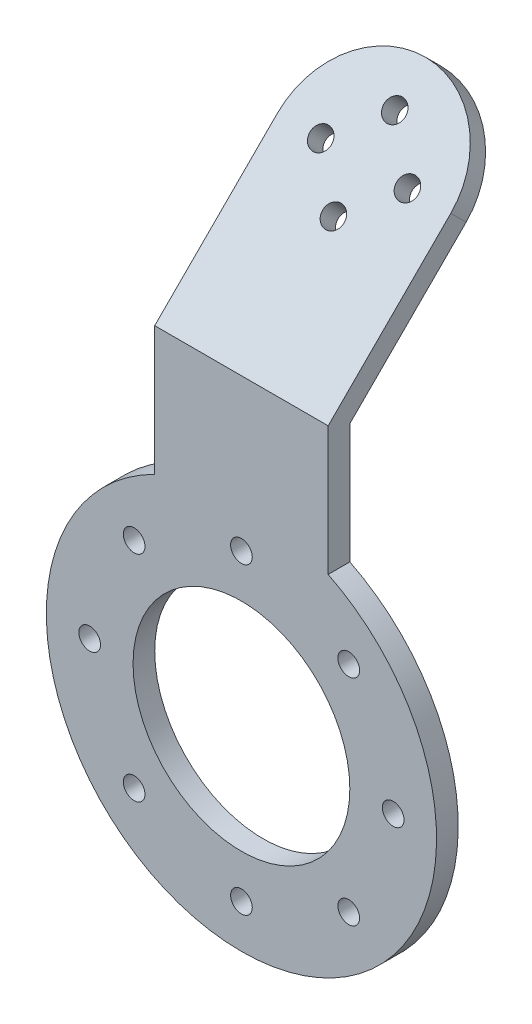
ISO-10303-21;
HEADER;
FILE_DESCRIPTION(('STEP AP214'),'2;1');
FILE_NAME('part.step','',(''),(''),'','','');
FILE_SCHEMA(('AUTOMOTIVE_DESIGN { 1 0 10303 214 1 1 1 1 }'));
ENDSEC;
DATA;
#1=APPLICATION_CONTEXT('core data for automotive mechanical design processes');
#2=APPLICATION_PROTOCOL_DEFINITION('international standard','automotive_design',2000,#1);
#3=PRODUCT_CONTEXT('',#1,'mechanical');
#4=PRODUCT('Part','Part','',(#3));
#5=PRODUCT_RELATED_PRODUCT_CATEGORY('part','',(#4));
#6=PRODUCT_DEFINITION_FORMATION('','',#4);
#7=PRODUCT_DEFINITION_CONTEXT('part definition',#1,'design');
#8=PRODUCT_DEFINITION('design','',#6,#7);
#9=PRODUCT_DEFINITION_SHAPE('','',#8);
#10=(LENGTH_UNIT() NAMED_UNIT(*) SI_UNIT(.MILLI.,.METRE.));
#11=(NAMED_UNIT(*) PLANE_ANGLE_UNIT() SI_UNIT($,.RADIAN.));
#12=(NAMED_UNIT(*) SI_UNIT($,.STERADIAN.) SOLID_ANGLE_UNIT());
#13=UNCERTAINTY_MEASURE_WITH_UNIT(LENGTH_MEASURE(1.E-05),#10,'distance_accuracy_value','');
#14=(GEOMETRIC_REPRESENTATION_CONTEXT(3) GLOBAL_UNCERTAINTY_ASSIGNED_CONTEXT((#13)) GLOBAL_UNIT_ASSIGNED_CONTEXT((#10,
#11,#12)) REPRESENTATION_CONTEXT('',''));
#15=CARTESIAN_POINT('',(0.,0.,0.));
#16=DIRECTION('',(0.,0.,1.));
#17=DIRECTION('',(1.,0.,0.));
#18=AXIS2_PLACEMENT_3D('',#15,#16,#17);
#19=CARTESIAN_POINT('',(0.,0.,3.175));
#20=DIRECTION('',(0.,0.,1.));
#21=DIRECTION('',(1.,0.,0.));
#22=AXIS2_PLACEMENT_3D('',#19,#20,#21);
#23=PLANE('',#22);
#24=CARTESIAN_POINT('',(15.7154482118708,15.7154482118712,3.175));
#25=DIRECTION('',(0.,0.,1.));
#26=DIRECTION('',(0.707106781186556,-0.707106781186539,0.));
#27=AXIS2_PLACEMENT_3D('',#24,#25,#26);
#28=CIRCLE('',#27,1.5875);
#29=CARTESIAN_POINT('',(16.8379802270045,14.5929161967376,3.175));
#30=VERTEX_POINT('',#29);
#31=EDGE_CURVE('E145',#30,#30,#28,.T.);
#32=ORIENTED_EDGE('',*,*,#31,.F.);
#33=EDGE_LOOP('',(#32));
#34=FACE_BOUND('',#33,.T.);
#35=CARTESIAN_POINT('',(22.225,2.32794653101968E-13,3.175));
#36=DIRECTION('',(0.,0.,1.));
#37=DIRECTION('',(0.,-1.,0.));
#38=AXIS2_PLACEMENT_3D('',#35,#36,#37);
#39=CIRCLE('',#38,1.5875);
#40=CARTESIAN_POINT('',(22.225,-1.58749999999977,3.175));
#41=VERTEX_POINT('',#40);
#42=EDGE_CURVE('E135',#41,#41,#39,.T.);
#43=ORIENTED_EDGE('',*,*,#42,.F.);
#44=EDGE_LOOP('',(#43));
#45=FACE_BOUND('',#44,.T.);
#46=CARTESIAN_POINT('',(15.7154482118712,-15.7154482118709,3.175));
#47=DIRECTION('',(0.,0.,1.));
#48=DIRECTION('',(-0.707106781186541,-0.707106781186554,0.));
#49=AXIS2_PLACEMENT_3D('',#46,#47,#48);
#50=CIRCLE('',#49,1.5875);
#51=CARTESIAN_POINT('',(14.5929161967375,-16.8379802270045,3.175));
#52=VERTEX_POINT('',#51);
#53=EDGE_CURVE('E132',#52,#52,#50,.T.);
#54=ORIENTED_EDGE('',*,*,#53,.F.);
#55=EDGE_LOOP('',(#54));
#56=FACE_BOUND('',#55,.T.);
#57=CARTESIAN_POINT('',(1.55196435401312E-13,-22.225,3.175));
#58=DIRECTION('',(0.,0.,1.));
#59=DIRECTION('',(-1.,0.,0.));
#60=AXIS2_PLACEMENT_3D('',#57,#58,#59);
#61=CIRCLE('',#60,1.5875);
#62=CARTESIAN_POINT('',(-1.58749999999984,-22.225,3.175));
#63=VERTEX_POINT('',#62);
#64=EDGE_CURVE('E129',#63,#63,#61,.T.);
#65=ORIENTED_EDGE('',*,*,#64,.F.);
#66=EDGE_LOOP('',(#65));
#67=FACE_BOUND('',#66,.T.);
#68=CARTESIAN_POINT('',(-15.7154482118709,-15.7154482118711,3.175));
#69=DIRECTION('',(0.,0.,1.));
#70=DIRECTION('',(-0.707106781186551,0.707106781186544,0.));
#71=AXIS2_PLACEMENT_3D('',#68,#69,#70);
#72=CIRCLE('',#71,1.5875);
#73=CARTESIAN_POINT('',(-16.8379802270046,-14.5929161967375,3.175));
#74=VERTEX_POINT('',#73);
#75=EDGE_CURVE('E125',#74,#74,#72,.T.);
#76=ORIENTED_EDGE('',*,*,#75,.F.);
#77=EDGE_LOOP('',(#76));
#78=FACE_BOUND('',#77,.T.);
#79=CARTESIAN_POINT('',(-22.225,0.,3.175));
#80=DIRECTION('',(0.,0.,1.));
#81=DIRECTION('',(0.,1.,0.));
#82=AXIS2_PLACEMENT_3D('',#79,#80,#81);
#83=CIRCLE('',#82,1.5875);
#84=CARTESIAN_POINT('',(-22.225,1.58749999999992,3.175));
#85=VERTEX_POINT('',#84);
#86=EDGE_CURVE('E121',#85,#85,#83,.T.);
#87=ORIENTED_EDGE('',*,*,#86,.F.);
#88=EDGE_LOOP('',(#87));
#89=FACE_BOUND('',#88,.T.);
#90=CARTESIAN_POINT('',(-15.715448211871,15.715448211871,3.175));
#91=DIRECTION('',(0.,0.,1.));
#92=DIRECTION('',(0.707106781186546,0.707106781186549,0.));
#93=AXIS2_PLACEMENT_3D('',#90,#91,#92);
#94=CIRCLE('',#93,1.5875);
#95=CARTESIAN_POINT('',(-14.5929161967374,16.8379802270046,3.175));
#96=VERTEX_POINT('',#95);
#97=EDGE_CURVE('E117',#96,#96,#94,.T.);
#98=ORIENTED_EDGE('',*,*,#97,.F.);
#99=EDGE_LOOP('',(#98));
#100=FACE_BOUND('',#99,.T.);
#101=CARTESIAN_POINT('',(0.,22.225,3.175));
#102=DIRECTION('',(0.,0.,1.));
#103=DIRECTION('',(1.,0.,0.));
#104=AXIS2_PLACEMENT_3D('',#101,#102,#103);
#105=CIRCLE('',#104,1.5875);
#106=CARTESIAN_POINT('',(1.5875,22.225,3.175));
#107=VERTEX_POINT('',#106);
#108=EDGE_CURVE('E113',#107,#107,#105,.T.);
#109=ORIENTED_EDGE('',*,*,#108,.F.);
#110=EDGE_LOOP('',(#109));
#111=FACE_BOUND('',#110,.T.);
#112=CARTESIAN_POINT('',(0.,0.,3.175));
#113=DIRECTION('',(0.,0.,1.));
#114=DIRECTION('',(1.,0.,0.));
#115=AXIS2_PLACEMENT_3D('',#112,#113,#114);
#116=CIRCLE('',#115,28.575);
#117=CARTESIAN_POINT('',(-12.7,25.5976683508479,3.175));
#118=VERTEX_POINT('',#117);
#119=CARTESIAN_POINT('',(12.7,25.5976683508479,3.175));
#120=VERTEX_POINT('',#119);
#121=EDGE_CURVE('E89',#118,#120,#116,.T.);
#122=ORIENTED_EDGE('',*,*,#121,.T.);
#123=DIRECTION('',(0.,1.,0.));
#124=VECTOR('',#123,1.);
#125=CARTESIAN_POINT('',(12.7,25.5976683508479,3.175));
#126=LINE('',#125,#124);
#127=CARTESIAN_POINT('',(12.7,44.45,3.175));
#128=VERTEX_POINT('',#127);
#129=EDGE_CURVE('E79',#120,#128,#126,.T.);
#130=ORIENTED_EDGE('',*,*,#129,.T.);
#131=DIRECTION('',(-1.,0.,0.));
#132=VECTOR('',#131,1.);
#133=CARTESIAN_POINT('',(-12.7,44.45,3.175));
#134=LINE('',#133,#132);
#135=CARTESIAN_POINT('',(-12.7,44.45,3.175));
#136=VERTEX_POINT('',#135);
#137=EDGE_CURVE('E88',#128,#136,#134,.T.);
#138=ORIENTED_EDGE('',*,*,#137,.T.);
#139=DIRECTION('',(0.,-1.,0.));
#140=VECTOR('',#139,1.);
#141=CARTESIAN_POINT('',(-12.7,25.5976683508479,3.175));
#142=LINE('',#141,#140);
#143=EDGE_CURVE('E49',#136,#118,#142,.T.);
#144=ORIENTED_EDGE('',*,*,#143,.T.);
#145=EDGE_LOOP('',(#122,#130,#138,#144));
#146=FACE_BOUND('',#145,.T.);
#147=CARTESIAN_POINT('',(0.,0.,3.175));
#148=DIRECTION('',(0.,0.,1.));
#149=DIRECTION('',(1.,0.,0.));
#150=AXIS2_PLACEMENT_3D('',#147,#148,#149);
#151=CIRCLE('',#150,15.875);
#152=CARTESIAN_POINT('',(15.875,0.,3.175));
#153=VERTEX_POINT('',#152);
#154=EDGE_CURVE('E99',#153,#153,#151,.T.);
#155=ORIENTED_EDGE('',*,*,#154,.F.);
#156=EDGE_LOOP('',(#155));
#157=FACE_BOUND('',#156,.T.);
#158=ADVANCED_FACE('F30',(#34,#45,#56,#67,#78,#89,#100,#111,#146,#157),#23,.T.);
#159=CARTESIAN_POINT('',(0.,0.,0.));
#160=DIRECTION('',(0.,0.,1.));
#161=DIRECTION('',(1.,0.,0.));
#162=AXIS2_PLACEMENT_3D('',#159,#160,#161);
#163=PLANE('',#162);
#164=CARTESIAN_POINT('',(15.7154482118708,15.7154482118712,0.));
#165=DIRECTION('',(0.,0.,1.));
#166=DIRECTION('',(1.,0.,0.));
#167=AXIS2_PLACEMENT_3D('',#164,#165,#166);
#168=CIRCLE('',#167,1.5875);
#169=CARTESIAN_POINT('',(17.3029482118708,15.7154482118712,0.));
#170=VERTEX_POINT('',#169);
#171=EDGE_CURVE('E34',#170,#170,#168,.T.);
#172=ORIENTED_EDGE('',*,*,#171,.T.);
#173=EDGE_LOOP('',(#172));
#174=FACE_BOUND('',#173,.T.);
#175=CARTESIAN_POINT('',(22.225,2.32794653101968E-13,0.));
#176=DIRECTION('',(0.,0.,1.));
#177=DIRECTION('',(1.,0.,0.));
#178=AXIS2_PLACEMENT_3D('',#175,#176,#177);
#179=CIRCLE('',#178,1.5875);
#180=CARTESIAN_POINT('',(23.8125,2.32794653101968E-13,0.));
#181=VERTEX_POINT('',#180);
#182=EDGE_CURVE('E133',#181,#181,#179,.T.);
#183=ORIENTED_EDGE('',*,*,#182,.T.);
#184=EDGE_LOOP('',(#183));
#185=FACE_BOUND('',#184,.T.);
#186=CARTESIAN_POINT('',(15.7154482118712,-15.7154482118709,0.));
#187=DIRECTION('',(0.,0.,1.));
#188=DIRECTION('',(1.,0.,0.));
#189=AXIS2_PLACEMENT_3D('',#186,#187,#188);
#190=CIRCLE('',#189,1.5875);
#191=CARTESIAN_POINT('',(17.3029482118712,-15.7154482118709,0.));
#192=VERTEX_POINT('',#191);
#193=EDGE_CURVE('E130',#192,#192,#190,.T.);
#194=ORIENTED_EDGE('',*,*,#193,.T.);
#195=EDGE_LOOP('',(#194));
#196=FACE_BOUND('',#195,.T.);
#197=CARTESIAN_POINT('',(1.55196435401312E-13,-22.225,0.));
#198=DIRECTION('',(0.,0.,1.));
#199=DIRECTION('',(1.,0.,0.));
#200=AXIS2_PLACEMENT_3D('',#197,#198,#199);
#201=CIRCLE('',#200,1.5875);
#202=CARTESIAN_POINT('',(1.58750000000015,-22.225,0.));
#203=VERTEX_POINT('',#202);
#204=EDGE_CURVE('E126',#203,#203,#201,.T.);
#205=ORIENTED_EDGE('',*,*,#204,.T.);
#206=EDGE_LOOP('',(#205));
#207=FACE_BOUND('',#206,.T.);
#208=CARTESIAN_POINT('',(-15.7154482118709,-15.7154482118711,0.));
#209=DIRECTION('',(0.,0.,1.));
#210=DIRECTION('',(1.,0.,0.));
#211=AXIS2_PLACEMENT_3D('',#208,#209,#210);
#212=CIRCLE('',#211,1.5875);
#213=CARTESIAN_POINT('',(-14.1279482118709,-15.7154482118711,0.));
#214=VERTEX_POINT('',#213);
#215=EDGE_CURVE('E122',#214,#214,#212,.T.);
#216=ORIENTED_EDGE('',*,*,#215,.T.);
#217=EDGE_LOOP('',(#216));
#218=FACE_BOUND('',#217,.T.);
#219=CARTESIAN_POINT('',(-22.225,0.,0.));
#220=DIRECTION('',(0.,0.,1.));
#221=DIRECTION('',(1.,0.,0.));
#222=AXIS2_PLACEMENT_3D('',#219,#220,#221);
#223=CIRCLE('',#222,1.5875);
#224=CARTESIAN_POINT('',(-20.6375,0.,0.));
#225=VERTEX_POINT('',#224);
#226=EDGE_CURVE('E118',#225,#225,#223,.T.);
#227=ORIENTED_EDGE('',*,*,#226,.T.);
#228=EDGE_LOOP('',(#227));
#229=FACE_BOUND('',#228,.T.);
#230=CARTESIAN_POINT('',(-15.715448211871,15.715448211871,0.));
#231=DIRECTION('',(0.,0.,1.));
#232=DIRECTION('',(1.,0.,0.));
#233=AXIS2_PLACEMENT_3D('',#230,#231,#232);
#234=CIRCLE('',#233,1.5875);
#235=CARTESIAN_POINT('',(-14.127948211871,15.715448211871,0.));
#236=VERTEX_POINT('',#235);
#237=EDGE_CURVE('E114',#236,#236,#234,.T.);
#238=ORIENTED_EDGE('',*,*,#237,.T.);
#239=EDGE_LOOP('',(#238));
#240=FACE_BOUND('',#239,.T.);
#241=CARTESIAN_POINT('',(0.,22.225,0.));
#242=DIRECTION('',(0.,0.,1.));
#243=DIRECTION('',(1.,0.,0.));
#244=AXIS2_PLACEMENT_3D('',#241,#242,#243);
#245=CIRCLE('',#244,1.5875);
#246=CARTESIAN_POINT('',(1.5875,22.225,0.));
#247=VERTEX_POINT('',#246);
#248=EDGE_CURVE('E110',#247,#247,#245,.T.);
#249=ORIENTED_EDGE('',*,*,#248,.T.);
#250=EDGE_LOOP('',(#249));
#251=FACE_BOUND('',#250,.T.);
#252=DIRECTION('',(0.,-1.,0.));
#253=VECTOR('',#252,1.);
#254=CARTESIAN_POINT('',(-12.7,25.5976683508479,0.));
#255=LINE('',#254,#253);
#256=CARTESIAN_POINT('',(-12.7,43.1348719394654,0.));
#257=VERTEX_POINT('',#256);
#258=CARTESIAN_POINT('',(-12.7,25.5976683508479,0.));
#259=VERTEX_POINT('',#258);
#260=EDGE_CURVE('E95',#257,#259,#255,.T.);
#261=ORIENTED_EDGE('',*,*,#260,.F.);
#262=DIRECTION('',(1.,0.,0.));
#263=VECTOR('',#262,1.);
#264=CARTESIAN_POINT('',(0.,43.1348719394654,0.));
#265=LINE('',#264,#263);
#266=CARTESIAN_POINT('',(12.7,43.1348719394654,0.));
#267=VERTEX_POINT('',#266);
#268=EDGE_CURVE('E176',#257,#267,#265,.T.);
#269=ORIENTED_EDGE('',*,*,#268,.T.);
#270=DIRECTION('',(0.,1.,0.));
#271=VECTOR('',#270,1.);
#272=CARTESIAN_POINT('',(12.7,25.5976683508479,0.));
#273=LINE('',#272,#271);
#274=CARTESIAN_POINT('',(12.7,25.5976683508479,0.));
#275=VERTEX_POINT('',#274);
#276=EDGE_CURVE('E62',#275,#267,#273,.T.);
#277=ORIENTED_EDGE('',*,*,#276,.F.);
#278=CARTESIAN_POINT('',(0.,0.,0.));
#279=DIRECTION('',(0.,0.,1.));
#280=DIRECTION('',(1.,0.,0.));
#281=AXIS2_PLACEMENT_3D('',#278,#279,#280);
#282=CIRCLE('',#281,28.575);
#283=EDGE_CURVE('E97',#259,#275,#282,.T.);
#284=ORIENTED_EDGE('',*,*,#283,.F.);
#285=EDGE_LOOP('',(#261,#269,#277,#284));
#286=FACE_BOUND('',#285,.T.);
#287=CARTESIAN_POINT('',(0.,0.,0.));
#288=DIRECTION('',(0.,0.,1.));
#289=DIRECTION('',(1.,0.,0.));
#290=AXIS2_PLACEMENT_3D('',#287,#288,#289);
#291=CIRCLE('',#290,15.875);
#292=CARTESIAN_POINT('',(15.875,0.,0.));
#293=VERTEX_POINT('',#292);
#294=EDGE_CURVE('E103',#293,#293,#291,.T.);
#295=ORIENTED_EDGE('',*,*,#294,.T.);
#296=EDGE_LOOP('',(#295));
#297=FACE_BOUND('',#296,.T.);
#298=ADVANCED_FACE('F187',(#174,#185,#196,#207,#218,#229,#240,#251,#286,#297),#163,.F.);
#299=CARTESIAN_POINT('',(0.,0.,3.175));
#300=DIRECTION('',(0.,0.,-1.));
#301=DIRECTION('',(-1.,0.,0.));
#302=AXIS2_PLACEMENT_3D('',#299,#300,#301);
#303=CYLINDRICAL_SURFACE('',#302,28.575);
#304=ORIENTED_EDGE('',*,*,#283,.T.);
#305=DIRECTION('',(0.,0.,-1.));
#306=VECTOR('',#305,1.);
#307=CARTESIAN_POINT('',(12.7,25.5976683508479,3.175));
#308=LINE('',#307,#306);
#309=EDGE_CURVE('E11',#120,#275,#308,.T.);
#310=ORIENTED_EDGE('',*,*,#309,.F.);
#311=ORIENTED_EDGE('',*,*,#121,.F.);
#312=DIRECTION('',(0.,0.,-1.));
#313=VECTOR('',#312,1.);
#314=CARTESIAN_POINT('',(-12.7,25.5976683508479,3.175));
#315=LINE('',#314,#313);
#316=EDGE_CURVE('E40',#118,#259,#315,.T.);
#317=ORIENTED_EDGE('',*,*,#316,.T.);
#318=EDGE_LOOP('',(#304,#310,#311,#317));
#319=FACE_BOUND('',#318,.T.);
#320=ADVANCED_FACE('F32',(#319),#303,.T.);
#321=CARTESIAN_POINT('',(12.7,25.5976683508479,3.175));
#322=DIRECTION('',(-1.,0.,0.));
#323=DIRECTION('',(0.,-1.,0.));
#324=AXIS2_PLACEMENT_3D('',#321,#322,#323);
#325=PLANE('',#324);
#326=DIRECTION('',(0.,0.707106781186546,-0.707106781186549));
#327=VECTOR('',#326,1.);
#328=CARTESIAN_POINT('',(12.7,62.4105122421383,-14.7855122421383));
#329=LINE('',#328,#327);
#330=CARTESIAN_POINT('',(12.7,62.4105122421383,-14.7855122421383));
#331=VERTEX_POINT('',#330);
#332=EDGE_CURVE('E86',#128,#331,#329,.T.);
#333=ORIENTED_EDGE('',*,*,#332,.F.);
#334=ORIENTED_EDGE('',*,*,#129,.F.);
#335=ORIENTED_EDGE('',*,*,#309,.T.);
#336=ORIENTED_EDGE('',*,*,#276,.T.);
#337=DIRECTION('',(0.,0.707106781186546,-0.707106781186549));
#338=VECTOR('',#337,1.);
#339=CARTESIAN_POINT('',(12.7,60.165448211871,-17.0305762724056));
#340=LINE('',#339,#338);
#341=CARTESIAN_POINT('',(12.7,60.165448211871,-17.0305762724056));
#342=VERTEX_POINT('',#341);
#343=EDGE_CURVE('E71',#267,#342,#340,.T.);
#344=ORIENTED_EDGE('',*,*,#343,.T.);
#345=DIRECTION('',(0.,0.707106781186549,0.707106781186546));
#346=VECTOR('',#345,1.);
#347=CARTESIAN_POINT('',(12.7,60.165448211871,-17.0305762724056));
#348=LINE('',#347,#346);
#349=EDGE_CURVE('E167',#342,#331,#348,.T.);
#350=ORIENTED_EDGE('',*,*,#349,.T.);
#351=EDGE_LOOP('',(#333,#334,#335,#336,#344,#350));
#352=FACE_BOUND('',#351,.T.);
#353=ADVANCED_FACE('F80',(#352),#325,.F.);
#354=CARTESIAN_POINT('',(-12.7,25.5976683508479,3.175));
#355=DIRECTION('',(1.,0.,0.));
#356=DIRECTION('',(0.,0.,-1.));
#357=AXIS2_PLACEMENT_3D('',#354,#355,#356);
#358=PLANE('',#357);
#359=DIRECTION('',(0.,-0.707106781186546,0.707106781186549));
#360=VECTOR('',#359,1.);
#361=CARTESIAN_POINT('',(-12.7,42.2049359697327,0.929935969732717));
#362=LINE('',#361,#360);
#363=CARTESIAN_POINT('',(-12.7,60.165448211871,-17.0305762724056));
#364=VERTEX_POINT('',#363);
#365=EDGE_CURVE('E164',#364,#257,#362,.T.);
#366=ORIENTED_EDGE('',*,*,#365,.T.);
#367=ORIENTED_EDGE('',*,*,#260,.T.);
#368=ORIENTED_EDGE('',*,*,#316,.F.);
#369=ORIENTED_EDGE('',*,*,#143,.F.);
#370=DIRECTION('',(0.,-0.707106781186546,0.707106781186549));
#371=VECTOR('',#370,1.);
#372=CARTESIAN_POINT('',(-12.7,44.45,3.175));
#373=LINE('',#372,#371);
#374=CARTESIAN_POINT('',(-12.7,62.4105122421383,-14.7855122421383));
#375=VERTEX_POINT('',#374);
#376=EDGE_CURVE('E161',#375,#136,#373,.T.);
#377=ORIENTED_EDGE('',*,*,#376,.F.);
#378=DIRECTION('',(0.,0.707106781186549,0.707106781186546));
#379=VECTOR('',#378,1.);
#380=CARTESIAN_POINT('',(-12.7,60.165448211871,-17.0305762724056));
#381=LINE('',#380,#379);
#382=EDGE_CURVE('E173',#364,#375,#381,.T.);
#383=ORIENTED_EDGE('',*,*,#382,.F.);
#384=EDGE_LOOP('',(#366,#367,#368,#369,#377,#383));
#385=FACE_BOUND('',#384,.T.);
#386=ADVANCED_FACE('F183',(#385),#358,.F.);
#387=CARTESIAN_POINT('',(0.,0.,3.175));
#388=DIRECTION('',(0.,0.,-1.));
#389=DIRECTION('',(-1.,0.,0.));
#390=AXIS2_PLACEMENT_3D('',#387,#388,#389);
#391=CYLINDRICAL_SURFACE('',#390,15.875);
#392=ORIENTED_EDGE('',*,*,#154,.T.);
#393=EDGE_LOOP('',(#392));
#394=FACE_BOUND('',#393,.T.);
#395=ORIENTED_EDGE('',*,*,#294,.F.);
#396=EDGE_LOOP('',(#395));
#397=FACE_BOUND('',#396,.T.);
#398=ADVANCED_FACE('F227',(#394,#397),#391,.F.);
#399=CARTESIAN_POINT('',(0.,60.165448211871,-17.0305762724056));
#400=DIRECTION('',(0.,-0.707106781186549,-0.707106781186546));
#401=DIRECTION('',(0.,0.707106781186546,-0.707106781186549));
#402=AXIS2_PLACEMENT_3D('',#399,#400,#401);
#403=PLANE('',#402);
#404=CARTESIAN_POINT('',(6.35000000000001,60.165448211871,-17.0305762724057));
#405=DIRECTION('',(0.,-0.707106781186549,-0.707106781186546));
#406=DIRECTION('',(0.,0.707106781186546,-0.707106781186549));
#407=AXIS2_PLACEMENT_3D('',#404,#405,#406);
#408=CIRCLE('',#407,1.5875);
#409=CARTESIAN_POINT('',(6.35000000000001,61.2879802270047,-18.1531082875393));
#410=VERTEX_POINT('',#409);
#411=EDGE_CURVE('E375',#410,#410,#408,.T.);
#412=ORIENTED_EDGE('',*,*,#411,.F.);
#413=EDGE_LOOP('',(#412));
#414=FACE_BOUND('',#413,.T.);
#415=CARTESIAN_POINT('',(0.,55.6753201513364,-12.540448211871));
#416=DIRECTION('',(0.,-0.707106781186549,-0.707106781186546));
#417=DIRECTION('',(0.,0.707106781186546,-0.707106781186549));
#418=AXIS2_PLACEMENT_3D('',#415,#416,#417);
#419=CIRCLE('',#418,1.5875);
#420=CARTESIAN_POINT('',(0.,56.79785216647,-13.6629802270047));
#421=VERTEX_POINT('',#420);
#422=EDGE_CURVE('E384',#421,#421,#419,.T.);
#423=ORIENTED_EDGE('',*,*,#422,.F.);
#424=EDGE_LOOP('',(#423));
#425=FACE_BOUND('',#424,.T.);
#426=CARTESIAN_POINT('',(-6.35000000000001,60.165448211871,-17.0305762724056));
#427=DIRECTION('',(0.,-0.707106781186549,-0.707106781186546));
#428=DIRECTION('',(0.,0.707106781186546,-0.707106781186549));
#429=AXIS2_PLACEMENT_3D('',#426,#427,#428);
#430=CIRCLE('',#429,1.5875);
#431=CARTESIAN_POINT('',(-6.35000000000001,61.2879802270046,-18.1531082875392));
#432=VERTEX_POINT('',#431);
#433=EDGE_CURVE('E390',#432,#432,#430,.T.);
#434=ORIENTED_EDGE('',*,*,#433,.F.);
#435=EDGE_LOOP('',(#434));
#436=FACE_BOUND('',#435,.T.);
#437=CARTESIAN_POINT('',(0.,64.6555762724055,-21.5207043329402));
#438=DIRECTION('',(0.,-0.707106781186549,-0.707106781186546));
#439=DIRECTION('',(0.,0.707106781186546,-0.707106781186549));
#440=AXIS2_PLACEMENT_3D('',#437,#438,#439);
#441=CIRCLE('',#440,1.5875);
#442=CARTESIAN_POINT('',(0.,65.7781082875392,-22.6432363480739));
#443=VERTEX_POINT('',#442);
#444=EDGE_CURVE('E395',#443,#443,#441,.T.);
#445=ORIENTED_EDGE('',*,*,#444,.F.);
#446=EDGE_LOOP('',(#445));
#447=FACE_BOUND('',#446,.T.);
#448=ORIENTED_EDGE('',*,*,#268,.F.);
#449=ORIENTED_EDGE('',*,*,#365,.F.);
#450=CARTESIAN_POINT('',(0.,60.165448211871,-17.0305762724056));
#451=DIRECTION('',(0.,0.707106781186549,0.707106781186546));
#452=DIRECTION('',(0.,0.707106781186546,-0.707106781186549));
#453=AXIS2_PLACEMENT_3D('',#450,#451,#452);
#454=CIRCLE('',#453,12.7);
#455=EDGE_CURVE('E160',#342,#364,#454,.T.);
#456=ORIENTED_EDGE('',*,*,#455,.F.);
#457=ORIENTED_EDGE('',*,*,#343,.F.);
#458=EDGE_LOOP('',(#448,#449,#456,#457));
#459=FACE_BOUND('',#458,.T.);
#460=ADVANCED_FACE('F196',(#414,#425,#436,#447,#459),#403,.T.);
#461=CARTESIAN_POINT('',(0.,60.165448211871,-17.0305762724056));
#462=DIRECTION('',(0.,0.707106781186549,0.707106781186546));
#463=DIRECTION('',(0.,-0.707106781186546,0.707106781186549));
#464=AXIS2_PLACEMENT_3D('',#461,#462,#463);
#465=CYLINDRICAL_SURFACE('',#464,12.7);
#466=CARTESIAN_POINT('',(0.,62.4105122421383,-14.7855122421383));
#467=DIRECTION('',(0.,0.707106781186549,0.707106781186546));
#468=DIRECTION('',(0.,0.707106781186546,-0.707106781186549));
#469=AXIS2_PLACEMENT_3D('',#466,#467,#468);
#470=CIRCLE('',#469,12.7);
#471=EDGE_CURVE('E169',#331,#375,#470,.T.);
#472=ORIENTED_EDGE('',*,*,#471,.F.);
#473=ORIENTED_EDGE('',*,*,#349,.F.);
#474=ORIENTED_EDGE('',*,*,#455,.T.);
#475=ORIENTED_EDGE('',*,*,#382,.T.);
#476=EDGE_LOOP('',(#472,#473,#474,#475));
#477=FACE_BOUND('',#476,.T.);
#478=ADVANCED_FACE('F195',(#477),#465,.T.);
#479=CARTESIAN_POINT('',(0.,62.4105122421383,-14.7855122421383));
#480=DIRECTION('',(0.,-0.707106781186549,-0.707106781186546));
#481=DIRECTION('',(0.,0.707106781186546,-0.707106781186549));
#482=AXIS2_PLACEMENT_3D('',#479,#480,#481);
#483=PLANE('',#482);
#484=CARTESIAN_POINT('',(6.35000000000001,62.4105122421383,-14.7855122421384));
#485=DIRECTION('',(0.,0.707106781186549,0.707106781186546));
#486=DIRECTION('',(-1.,0.,0.));
#487=AXIS2_PLACEMENT_3D('',#484,#485,#486);
#488=CIRCLE('',#487,1.5875);
#489=CARTESIAN_POINT('',(4.76250000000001,62.4105122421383,-14.7855122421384));
#490=VERTEX_POINT('',#489);
#491=EDGE_CURVE('E377',#490,#490,#488,.T.);
#492=ORIENTED_EDGE('',*,*,#491,.F.);
#493=EDGE_LOOP('',(#492));
#494=FACE_BOUND('',#493,.T.);
#495=CARTESIAN_POINT('',(0.,57.9203841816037,-10.2953841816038));
#496=DIRECTION('',(0.,0.707106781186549,0.707106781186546));
#497=DIRECTION('',(0.,0.707106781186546,-0.707106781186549));
#498=AXIS2_PLACEMENT_3D('',#495,#496,#497);
#499=CIRCLE('',#498,1.5875);
#500=CARTESIAN_POINT('',(0.,59.0429161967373,-11.4179161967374));
#501=VERTEX_POINT('',#500);
#502=EDGE_CURVE('E379',#501,#501,#499,.T.);
#503=ORIENTED_EDGE('',*,*,#502,.F.);
#504=EDGE_LOOP('',(#503));
#505=FACE_BOUND('',#504,.T.);
#506=CARTESIAN_POINT('',(-6.35000000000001,62.4105122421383,-14.7855122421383));
#507=DIRECTION('',(0.,0.707106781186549,0.707106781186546));
#508=DIRECTION('',(1.,0.,0.));
#509=AXIS2_PLACEMENT_3D('',#506,#507,#508);
#510=CIRCLE('',#509,1.5875);
#511=CARTESIAN_POINT('',(-4.76250000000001,62.4105122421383,-14.7855122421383));
#512=VERTEX_POINT('',#511);
#513=EDGE_CURVE('E387',#512,#512,#510,.T.);
#514=ORIENTED_EDGE('',*,*,#513,.F.);
#515=EDGE_LOOP('',(#514));
#516=FACE_BOUND('',#515,.T.);
#517=CARTESIAN_POINT('',(0.,66.9006403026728,-19.2756403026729));
#518=DIRECTION('',(0.,0.707106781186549,0.707106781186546));
#519=DIRECTION('',(0.,-0.707106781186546,0.707106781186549));
#520=AXIS2_PLACEMENT_3D('',#517,#518,#519);
#521=CIRCLE('',#520,1.5875);
#522=CARTESIAN_POINT('',(0.,65.7781082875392,-18.1531082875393));
#523=VERTEX_POINT('',#522);
#524=EDGE_CURVE('E393',#523,#523,#521,.T.);
#525=ORIENTED_EDGE('',*,*,#524,.F.);
#526=EDGE_LOOP('',(#525));
#527=FACE_BOUND('',#526,.T.);
#528=ORIENTED_EDGE('',*,*,#137,.F.);
#529=ORIENTED_EDGE('',*,*,#332,.T.);
#530=ORIENTED_EDGE('',*,*,#471,.T.);
#531=ORIENTED_EDGE('',*,*,#376,.T.);
#532=EDGE_LOOP('',(#528,#529,#530,#531));
#533=FACE_BOUND('',#532,.T.);
#534=ADVANCED_FACE('F200',(#494,#505,#516,#527,#533),#483,.F.);
#535=CARTESIAN_POINT('',(0.,22.225,-26.0108323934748));
#536=DIRECTION('',(0.,0.,1.));
#537=DIRECTION('',(1.,0.,0.));
#538=AXIS2_PLACEMENT_3D('',#535,#536,#537);
#539=CYLINDRICAL_SURFACE('',#538,1.5875);
#540=ORIENTED_EDGE('',*,*,#108,.T.);
#541=EDGE_LOOP('',(#540));
#542=FACE_BOUND('',#541,.T.);
#543=ORIENTED_EDGE('',*,*,#248,.F.);
#544=EDGE_LOOP('',(#543));
#545=FACE_BOUND('',#544,.T.);
#546=ADVANCED_FACE('F202',(#542,#545),#539,.F.);
#547=CARTESIAN_POINT('',(-15.715448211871,15.715448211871,-26.0108323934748));
#548=DIRECTION('',(0.,0.,1.));
#549=DIRECTION('',(1.,0.,0.));
#550=AXIS2_PLACEMENT_3D('',#547,#548,#549);
#551=CYLINDRICAL_SURFACE('',#550,1.5875);
#552=ORIENTED_EDGE('',*,*,#97,.T.);
#553=EDGE_LOOP('',(#552));
#554=FACE_BOUND('',#553,.T.);
#555=ORIENTED_EDGE('',*,*,#237,.F.);
#556=EDGE_LOOP('',(#555));
#557=FACE_BOUND('',#556,.T.);
#558=ADVANCED_FACE('F209',(#554,#557),#551,.F.);
#559=CARTESIAN_POINT('',(-22.225,0.,-26.0108323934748));
#560=DIRECTION('',(0.,0.,1.));
#561=DIRECTION('',(1.,0.,0.));
#562=AXIS2_PLACEMENT_3D('',#559,#560,#561);
#563=CYLINDRICAL_SURFACE('',#562,1.5875);
#564=ORIENTED_EDGE('',*,*,#86,.T.);
#565=EDGE_LOOP('',(#564));
#566=FACE_BOUND('',#565,.T.);
#567=ORIENTED_EDGE('',*,*,#226,.F.);
#568=EDGE_LOOP('',(#567));
#569=FACE_BOUND('',#568,.T.);
#570=ADVANCED_FACE('F253',(#566,#569),#563,.F.);
#571=CARTESIAN_POINT('',(-15.7154482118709,-15.7154482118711,-26.0108323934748));
#572=DIRECTION('',(0.,0.,1.));
#573=DIRECTION('',(1.,0.,0.));
#574=AXIS2_PLACEMENT_3D('',#571,#572,#573);
#575=CYLINDRICAL_SURFACE('',#574,1.5875);
#576=ORIENTED_EDGE('',*,*,#75,.T.);
#577=EDGE_LOOP('',(#576));
#578=FACE_BOUND('',#577,.T.);
#579=ORIENTED_EDGE('',*,*,#215,.F.);
#580=EDGE_LOOP('',(#579));
#581=FACE_BOUND('',#580,.T.);
#582=ADVANCED_FACE('F264',(#578,#581),#575,.F.);
#583=CARTESIAN_POINT('',(1.55196435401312E-13,-22.225,-26.0108323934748));
#584=DIRECTION('',(0.,0.,1.));
#585=DIRECTION('',(1.,0.,0.));
#586=AXIS2_PLACEMENT_3D('',#583,#584,#585);
#587=CYLINDRICAL_SURFACE('',#586,1.5875);
#588=ORIENTED_EDGE('',*,*,#64,.T.);
#589=EDGE_LOOP('',(#588));
#590=FACE_BOUND('',#589,.T.);
#591=ORIENTED_EDGE('',*,*,#204,.F.);
#592=EDGE_LOOP('',(#591));
#593=FACE_BOUND('',#592,.T.);
#594=ADVANCED_FACE('F274',(#590,#593),#587,.F.);
#595=CARTESIAN_POINT('',(15.7154482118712,-15.7154482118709,-26.0108323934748));
#596=DIRECTION('',(0.,0.,1.));
#597=DIRECTION('',(1.,0.,0.));
#598=AXIS2_PLACEMENT_3D('',#595,#596,#597);
#599=CYLINDRICAL_SURFACE('',#598,1.5875);
#600=ORIENTED_EDGE('',*,*,#53,.T.);
#601=EDGE_LOOP('',(#600));
#602=FACE_BOUND('',#601,.T.);
#603=ORIENTED_EDGE('',*,*,#193,.F.);
#604=EDGE_LOOP('',(#603));
#605=FACE_BOUND('',#604,.T.);
#606=ADVANCED_FACE('F284',(#602,#605),#599,.F.);
#607=CARTESIAN_POINT('',(22.225,2.32794653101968E-13,-26.0108323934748));
#608=DIRECTION('',(0.,0.,1.));
#609=DIRECTION('',(1.,0.,0.));
#610=AXIS2_PLACEMENT_3D('',#607,#608,#609);
#611=CYLINDRICAL_SURFACE('',#610,1.5875);
#612=ORIENTED_EDGE('',*,*,#42,.T.);
#613=EDGE_LOOP('',(#612));
#614=FACE_BOUND('',#613,.T.);
#615=ORIENTED_EDGE('',*,*,#182,.F.);
#616=EDGE_LOOP('',(#615));
#617=FACE_BOUND('',#616,.T.);
#618=ADVANCED_FACE('F294',(#614,#617),#611,.F.);
#619=CARTESIAN_POINT('',(15.7154482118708,15.7154482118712,-26.0108323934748));
#620=DIRECTION('',(0.,0.,1.));
#621=DIRECTION('',(1.,0.,0.));
#622=AXIS2_PLACEMENT_3D('',#619,#620,#621);
#623=CYLINDRICAL_SURFACE('',#622,1.5875);
#624=ORIENTED_EDGE('',*,*,#31,.T.);
#625=EDGE_LOOP('',(#624));
#626=FACE_BOUND('',#625,.T.);
#627=ORIENTED_EDGE('',*,*,#171,.F.);
#628=EDGE_LOOP('',(#627));
#629=FACE_BOUND('',#628,.T.);
#630=ADVANCED_FACE('F304',(#626,#629),#623,.F.);
#631=CARTESIAN_POINT('',(0.,15.7952241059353,-70.3810564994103));
#632=DIRECTION('',(0.,0.707106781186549,0.707106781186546));
#633=DIRECTION('',(0.,-0.707106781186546,0.707106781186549));
#634=AXIS2_PLACEMENT_3D('',#631,#632,#633);
#635=CYLINDRICAL_SURFACE('',#634,1.5875);
#636=ORIENTED_EDGE('',*,*,#444,.T.);
#637=EDGE_LOOP('',(#636));
#638=FACE_BOUND('',#637,.T.);
#639=ORIENTED_EDGE('',*,*,#524,.T.);
#640=EDGE_LOOP('',(#639));
#641=FACE_BOUND('',#640,.T.);
#642=ADVANCED_FACE('F313',(#638,#641),#635,.F.);
#643=CARTESIAN_POINT('',(-6.35000000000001,11.3050960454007,-65.8909284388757));
#644=DIRECTION('',(0.,0.707106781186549,0.707106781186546));
#645=DIRECTION('',(0.,-0.707106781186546,0.707106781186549));
#646=AXIS2_PLACEMENT_3D('',#643,#644,#645);
#647=CYLINDRICAL_SURFACE('',#646,1.5875);
#648=ORIENTED_EDGE('',*,*,#433,.T.);
#649=EDGE_LOOP('',(#648));
#650=FACE_BOUND('',#649,.T.);
#651=ORIENTED_EDGE('',*,*,#513,.T.);
#652=EDGE_LOOP('',(#651));
#653=FACE_BOUND('',#652,.T.);
#654=ADVANCED_FACE('F323',(#650,#653),#647,.F.);
#655=CARTESIAN_POINT('',(0.,6.81496798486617,-61.4008003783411));
#656=DIRECTION('',(0.,0.707106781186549,0.707106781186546));
#657=DIRECTION('',(0.,-0.707106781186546,0.707106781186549));
#658=AXIS2_PLACEMENT_3D('',#655,#656,#657);
#659=CYLINDRICAL_SURFACE('',#658,1.5875);
#660=ORIENTED_EDGE('',*,*,#422,.T.);
#661=EDGE_LOOP('',(#660));
#662=FACE_BOUND('',#661,.T.);
#663=ORIENTED_EDGE('',*,*,#502,.T.);
#664=EDGE_LOOP('',(#663));
#665=FACE_BOUND('',#664,.T.);
#666=ADVANCED_FACE('F348',(#662,#665),#659,.F.);
#667=CARTESIAN_POINT('',(6.35000000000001,11.3050960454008,-65.8909284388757));
#668=DIRECTION('',(0.,0.707106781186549,0.707106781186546));
#669=DIRECTION('',(0.,-0.707106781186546,0.707106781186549));
#670=AXIS2_PLACEMENT_3D('',#667,#668,#669);
#671=CYLINDRICAL_SURFACE('',#670,1.5875);
#672=ORIENTED_EDGE('',*,*,#411,.T.);
#673=EDGE_LOOP('',(#672));
#674=FACE_BOUND('',#673,.T.);
#675=ORIENTED_EDGE('',*,*,#491,.T.);
#676=EDGE_LOOP('',(#675));
#677=FACE_BOUND('',#676,.T.);
#678=ADVANCED_FACE('F358',(#674,#677),#671,.F.);
#679=CLOSED_SHELL('',(#158,#298,#320,#353,#386,#398,#460,#478,#534,#546,#558,#570,#582,#594,
#606,#618,#630,#642,#654,#666,#678));
#680=MANIFOLD_SOLID_BREP('B2',#679);
#681=ADVANCED_BREP_SHAPE_REPRESENTATION('',(#18,#680),#14);
#682=SHAPE_DEFINITION_REPRESENTATION(#9,#681);
ENDSEC;
END-ISO-10303-21;
